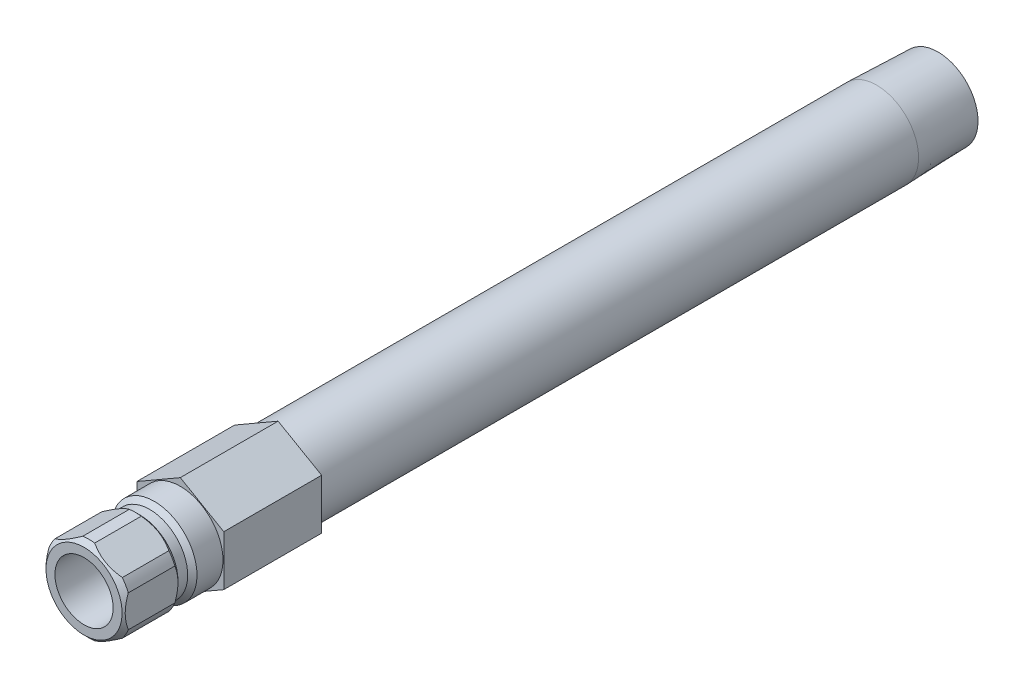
ISO-10303-21;
HEADER;
FILE_DESCRIPTION(('STEP AP214'),'2;1');
FILE_NAME('part.step','',(''),(''),'','','');
FILE_SCHEMA(('AUTOMOTIVE_DESIGN { 1 0 10303 214 1 1 1 1 }'));
ENDSEC;
DATA;
#1=APPLICATION_CONTEXT('core data for automotive mechanical design processes');
#2=APPLICATION_PROTOCOL_DEFINITION('international standard','automotive_design',2000,#1);
#3=PRODUCT_CONTEXT('',#1,'mechanical');
#4=PRODUCT('Part','Part','',(#3));
#5=PRODUCT_RELATED_PRODUCT_CATEGORY('part','',(#4));
#6=PRODUCT_DEFINITION_FORMATION('','',#4);
#7=PRODUCT_DEFINITION_CONTEXT('part definition',#1,'design');
#8=PRODUCT_DEFINITION('design','',#6,#7);
#9=PRODUCT_DEFINITION_SHAPE('','',#8);
#10=(LENGTH_UNIT() NAMED_UNIT(*) SI_UNIT(.MILLI.,.METRE.));
#11=(NAMED_UNIT(*) PLANE_ANGLE_UNIT() SI_UNIT($,.RADIAN.));
#12=(NAMED_UNIT(*) SI_UNIT($,.STERADIAN.) SOLID_ANGLE_UNIT());
#13=UNCERTAINTY_MEASURE_WITH_UNIT(LENGTH_MEASURE(1.E-05),#10,'distance_accuracy_value','');
#14=(GEOMETRIC_REPRESENTATION_CONTEXT(3) GLOBAL_UNCERTAINTY_ASSIGNED_CONTEXT((#13)) GLOBAL_UNIT_ASSIGNED_CONTEXT((#10,
#11,#12)) REPRESENTATION_CONTEXT('',''));
#15=CARTESIAN_POINT('',(0.,0.,0.));
#16=DIRECTION('',(0.,0.,1.));
#17=DIRECTION('',(1.,0.,0.));
#18=AXIS2_PLACEMENT_3D('',#15,#16,#17);
#19=CARTESIAN_POINT('',(0.,0.,12.8748331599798));
#20=DIRECTION('',(0.,0.,-1.));
#21=DIRECTION('',(0.,1.,0.));
#22=AXIS2_PLACEMENT_3D('',#19,#20,#21);
#23=CYLINDRICAL_SURFACE('',#22,6.985);
#24=DIRECTION('',(0.,0.,-1.));
#25=VECTOR('',#24,1.);
#26=CARTESIAN_POINT('',(5.50323442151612,-4.30170151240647,12.8748331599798));
#27=LINE('',#26,#25);
#28=CARTESIAN_POINT('',(5.50323442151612,-4.30170151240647,7.366));
#29=VERTEX_POINT('',#28);
#30=CARTESIAN_POINT('',(5.50323442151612,-4.30170151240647,14.986));
#31=VERTEX_POINT('',#30);
#32=EDGE_CURVE('E452',#29,#31,#27,.F.);
#33=ORIENTED_EDGE('',*,*,#32,.F.);
#34=CARTESIAN_POINT('',(0.,0.,7.366));
#35=DIRECTION('',(0.,0.,-1.));
#36=DIRECTION('',(0.,1.,0.));
#37=AXIS2_PLACEMENT_3D('',#34,#35,#36);
#38=CIRCLE('',#37,6.985);
#39=CARTESIAN_POINT('',(6.477,-2.6150900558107,7.366));
#40=VERTEX_POINT('',#39);
#41=EDGE_CURVE('E190',#40,#29,#38,.T.);
#42=ORIENTED_EDGE('',*,*,#41,.F.);
#43=DIRECTION('',(0.,0.,-1.));
#44=VECTOR('',#43,1.);
#45=CARTESIAN_POINT('',(6.477,-2.6150900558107,12.8748331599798));
#46=LINE('',#45,#44);
#47=CARTESIAN_POINT('',(6.477,-2.6150900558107,14.986));
#48=VERTEX_POINT('',#47);
#49=EDGE_CURVE('E367',#48,#40,#46,.T.);
#50=ORIENTED_EDGE('',*,*,#49,.F.);
#51=CARTESIAN_POINT('',(0.,0.,14.986));
#52=DIRECTION('',(0.,0.,-1.));
#53=DIRECTION('',(0.,1.,0.));
#54=AXIS2_PLACEMENT_3D('',#51,#52,#53);
#55=CIRCLE('',#54,6.985);
#56=EDGE_CURVE('E355',#48,#31,#55,.T.);
#57=ORIENTED_EDGE('',*,*,#56,.T.);
#58=EDGE_LOOP('',(#33,#42,#50,#57));
#59=FACE_BOUND('',#58,.T.);
#60=ADVANCED_FACE('F34',(#59),#23,.T.);
#61=DIRECTION('',(0.,0.,-1.));
#62=VECTOR('',#61,1.);
#63=CARTESIAN_POINT('',(6.477,2.6150900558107,12.8748331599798));
#64=LINE('',#63,#62);
#65=CARTESIAN_POINT('',(6.477,2.6150900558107,7.366));
#66=VERTEX_POINT('',#65);
#67=CARTESIAN_POINT('',(6.477,2.6150900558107,14.986));
#68=VERTEX_POINT('',#67);
#69=EDGE_CURVE('E279',#66,#68,#64,.F.);
#70=ORIENTED_EDGE('',*,*,#69,.F.);
#71=CARTESIAN_POINT('',(5.50323442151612,4.30170151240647,7.366));
#72=VERTEX_POINT('',#71);
#73=EDGE_CURVE('E193',#72,#66,#38,.T.);
#74=ORIENTED_EDGE('',*,*,#73,.F.);
#75=DIRECTION('',(0.,0.,-1.));
#76=VECTOR('',#75,1.);
#77=CARTESIAN_POINT('',(5.50323442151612,4.30170151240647,12.8748331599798));
#78=LINE('',#77,#76);
#79=CARTESIAN_POINT('',(5.50323442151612,4.30170151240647,14.986));
#80=VERTEX_POINT('',#79);
#81=EDGE_CURVE('E351',#80,#72,#78,.T.);
#82=ORIENTED_EDGE('',*,*,#81,.F.);
#83=EDGE_CURVE('E205',#80,#68,#55,.T.);
#84=ORIENTED_EDGE('',*,*,#83,.T.);
#85=EDGE_LOOP('',(#70,#74,#82,#84));
#86=FACE_BOUND('',#85,.T.);
#87=ADVANCED_FACE('F313',(#86),#23,.T.);
#88=DIRECTION('',(0.,0.,-1.));
#89=VECTOR('',#88,1.);
#90=CARTESIAN_POINT('',(0.973765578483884,6.91679156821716,12.8748331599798));
#91=LINE('',#90,#89);
#92=CARTESIAN_POINT('',(0.973765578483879,6.91679156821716,7.366));
#93=VERTEX_POINT('',#92);
#94=CARTESIAN_POINT('',(0.973765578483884,6.91679156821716,14.986));
#95=VERTEX_POINT('',#94);
#96=EDGE_CURVE('E370',#93,#95,#91,.F.);
#97=ORIENTED_EDGE('',*,*,#96,.F.);
#98=CARTESIAN_POINT('',(-0.97376557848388,6.91679156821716,7.366));
#99=VERTEX_POINT('',#98);
#100=EDGE_CURVE('E195',#99,#93,#38,.T.);
#101=ORIENTED_EDGE('',*,*,#100,.F.);
#102=DIRECTION('',(0.,0.,-1.));
#103=VECTOR('',#102,1.);
#104=CARTESIAN_POINT('',(-0.973765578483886,6.91679156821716,12.8748331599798));
#105=LINE('',#104,#103);
#106=CARTESIAN_POINT('',(-0.973765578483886,6.91679156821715,14.986));
#107=VERTEX_POINT('',#106);
#108=EDGE_CURVE('E54',#107,#99,#105,.T.);
#109=ORIENTED_EDGE('',*,*,#108,.F.);
#110=EDGE_CURVE('E201',#107,#95,#55,.T.);
#111=ORIENTED_EDGE('',*,*,#110,.T.);
#112=EDGE_LOOP('',(#97,#101,#109,#111));
#113=FACE_BOUND('',#112,.T.);
#114=ADVANCED_FACE('F318',(#113),#23,.T.);
#115=DIRECTION('',(0.,0.,-1.));
#116=VECTOR('',#115,1.);
#117=CARTESIAN_POINT('',(-5.50323442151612,4.30170151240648,12.8748331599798));
#118=LINE('',#117,#116);
#119=CARTESIAN_POINT('',(-5.50323442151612,4.30170151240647,7.366));
#120=VERTEX_POINT('',#119);
#121=CARTESIAN_POINT('',(-5.50323442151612,4.30170151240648,14.986));
#122=VERTEX_POINT('',#121);
#123=EDGE_CURVE('E349',#120,#122,#118,.F.);
#124=ORIENTED_EDGE('',*,*,#123,.F.);
#125=CARTESIAN_POINT('',(-6.477,2.61509005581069,7.366));
#126=VERTEX_POINT('',#125);
#127=EDGE_CURVE('E194',#126,#120,#38,.T.);
#128=ORIENTED_EDGE('',*,*,#127,.F.);
#129=DIRECTION('',(0.,0.,-1.));
#130=VECTOR('',#129,1.);
#131=CARTESIAN_POINT('',(-6.477,2.61509005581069,12.8748331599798));
#132=LINE('',#131,#130);
#133=CARTESIAN_POINT('',(-6.477,2.61509005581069,14.986));
#134=VERTEX_POINT('',#133);
#135=EDGE_CURVE('E62',#134,#126,#132,.T.);
#136=ORIENTED_EDGE('',*,*,#135,.F.);
#137=EDGE_CURVE('E204',#134,#122,#55,.T.);
#138=ORIENTED_EDGE('',*,*,#137,.T.);
#139=EDGE_LOOP('',(#124,#128,#136,#138));
#140=FACE_BOUND('',#139,.T.);
#141=ADVANCED_FACE('F329',(#140),#23,.T.);
#142=DIRECTION('',(0.,0.,-1.));
#143=VECTOR('',#142,1.);
#144=CARTESIAN_POINT('',(-6.477,-2.61509005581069,12.8748331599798));
#145=LINE('',#144,#143);
#146=CARTESIAN_POINT('',(-6.477,-2.61509005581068,7.366));
#147=VERTEX_POINT('',#146);
#148=CARTESIAN_POINT('',(-6.477,-2.61509005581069,14.986));
#149=VERTEX_POINT('',#148);
#150=EDGE_CURVE('E340',#147,#149,#145,.F.);
#151=ORIENTED_EDGE('',*,*,#150,.F.);
#152=CARTESIAN_POINT('',(-5.50323442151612,-4.30170151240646,7.366));
#153=VERTEX_POINT('',#152);
#154=EDGE_CURVE('E191',#153,#147,#38,.T.);
#155=ORIENTED_EDGE('',*,*,#154,.F.);
#156=DIRECTION('',(0.,0.,-1.));
#157=VECTOR('',#156,1.);
#158=CARTESIAN_POINT('',(-5.50323442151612,-4.30170151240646,12.8748331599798));
#159=LINE('',#158,#157);
#160=CARTESIAN_POINT('',(-5.50323442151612,-4.30170151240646,14.986));
#161=VERTEX_POINT('',#160);
#162=EDGE_CURVE('E168',#161,#153,#159,.T.);
#163=ORIENTED_EDGE('',*,*,#162,.F.);
#164=EDGE_CURVE('E342',#161,#149,#55,.T.);
#165=ORIENTED_EDGE('',*,*,#164,.T.);
#166=EDGE_LOOP('',(#151,#155,#163,#165));
#167=FACE_BOUND('',#166,.T.);
#168=ADVANCED_FACE('F322',(#167),#23,.T.);
#169=CARTESIAN_POINT('',(0.,0.,12.8748331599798));
#170=DIRECTION('',(0.,0.,-1.));
#171=DIRECTION('',(0.,1.,0.));
#172=AXIS2_PLACEMENT_3D('',#169,#170,#171);
#173=CYLINDRICAL_SURFACE('',#172,6.85799999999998);
#174=CARTESIAN_POINT('',(0.,0.,-113.919));
#175=DIRECTION('',(0.,0.,-1.));
#176=DIRECTION('',(0.,1.,0.));
#177=AXIS2_PLACEMENT_3D('',#174,#175,#176);
#178=CIRCLE('',#177,6.85799999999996);
#179=CARTESIAN_POINT('',(0.,6.858,-113.919));
#180=VERTEX_POINT('',#179);
#181=EDGE_CURVE('E520',#180,#180,#178,.T.);
#182=ORIENTED_EDGE('',*,*,#181,.F.);
#183=EDGE_LOOP('',(#182));
#184=FACE_BOUND('',#183,.T.);
#185=CARTESIAN_POINT('',(0.,0.,-16.002));
#186=DIRECTION('',(0.,0.,1.));
#187=DIRECTION('',(1.,0.,0.));
#188=AXIS2_PLACEMENT_3D('',#185,#186,#187);
#189=CIRCLE('',#188,6.85799999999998);
#190=CARTESIAN_POINT('',(6.85799999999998,0.,-16.002));
#191=VERTEX_POINT('',#190);
#192=EDGE_CURVE('E496',#191,#191,#189,.F.);
#193=ORIENTED_EDGE('',*,*,#192,.T.);
#194=EDGE_LOOP('',(#193));
#195=FACE_BOUND('',#194,.T.);
#196=ADVANCED_FACE('F328',(#184,#195),#173,.T.);
#197=CARTESIAN_POINT('',(0.,0.,12.8748331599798));
#198=DIRECTION('',(0.,0.,-1.));
#199=DIRECTION('',(0.,1.,0.));
#200=AXIS2_PLACEMENT_3D('',#197,#198,#199);
#201=CYLINDRICAL_SURFACE('',#200,4.7625);
#202=CARTESIAN_POINT('',(0.,0.,3.556));
#203=DIRECTION('',(0.,0.,-1.));
#204=DIRECTION('',(0.,1.,0.));
#205=AXIS2_PLACEMENT_3D('',#202,#203,#204);
#206=CIRCLE('',#205,4.76249999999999);
#207=CARTESIAN_POINT('',(0.,4.7625,3.556));
#208=VERTEX_POINT('',#207);
#209=EDGE_CURVE('E508',#208,#208,#206,.T.);
#210=ORIENTED_EDGE('',*,*,#209,.T.);
#211=EDGE_LOOP('',(#210));
#212=FACE_BOUND('',#211,.T.);
#213=CARTESIAN_POINT('',(0.,0.,15.748));
#214=DIRECTION('',(0.,0.,-1.));
#215=DIRECTION('',(0.,1.,0.));
#216=AXIS2_PLACEMENT_3D('',#213,#214,#215);
#217=CIRCLE('',#216,4.7625);
#218=CARTESIAN_POINT('',(0.,4.7625,15.748));
#219=VERTEX_POINT('',#218);
#220=EDGE_CURVE('E174',#219,#219,#217,.T.);
#221=ORIENTED_EDGE('',*,*,#220,.F.);
#222=EDGE_LOOP('',(#221));
#223=FACE_BOUND('',#222,.T.);
#224=ADVANCED_FACE('F36',(#212,#223),#201,.F.);
#225=CARTESIAN_POINT('',(0.,4.7625,15.748));
#226=DIRECTION('',(0.,0.,1.));
#227=DIRECTION('',(0.,-1.,0.));
#228=AXIS2_PLACEMENT_3D('',#225,#226,#227);
#229=PLANE('',#228);
#230=ORIENTED_EDGE('',*,*,#220,.T.);
#231=EDGE_LOOP('',(#230));
#232=FACE_BOUND('',#231,.T.);
#233=CARTESIAN_POINT('',(0.,0.,15.748));
#234=DIRECTION('',(0.,0.,-1.));
#235=DIRECTION('',(0.,1.,0.));
#236=AXIS2_PLACEMENT_3D('',#233,#234,#235);
#237=CIRCLE('',#236,6.223);
#238=CARTESIAN_POINT('',(0.,6.223,15.748));
#239=VERTEX_POINT('',#238);
#240=EDGE_CURVE('E206',#239,#239,#237,.T.);
#241=ORIENTED_EDGE('',*,*,#240,.F.);
#242=EDGE_LOOP('',(#241));
#243=FACE_BOUND('',#242,.T.);
#244=ADVANCED_FACE('F241',(#232,#243),#229,.T.);
#245=CARTESIAN_POINT('',(0.,0.,14.986));
#246=DIRECTION('',(0.,0.,-1.));
#247=DIRECTION('',(0.,1.,0.));
#248=AXIS2_PLACEMENT_3D('',#245,#246,#247);
#249=CONICAL_SURFACE('',#248,6.985,0.785398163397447);
#250=CARTESIAN_POINT('',(5.50369701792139,-4.30143443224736,14.9858));
#251=CARTESIAN_POINT('',(5.32269478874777,-4.40593611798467,15.0641166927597));
#252=CARTESIAN_POINT('',(5.13917907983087,-4.51188896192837,15.1353544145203));
#253=CARTESIAN_POINT('',(4.76736839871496,-4.72655395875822,15.2608524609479));
#254=CARTESIAN_POINT('',(4.57906245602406,-4.83527244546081,15.3150691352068));
#255=CARTESIAN_POINT('',(4.20553846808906,-5.05092662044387,15.401724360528));
#256=CARTESIAN_POINT('',(4.02044501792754,-5.15779037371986,15.4348622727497));
#257=CARTESIAN_POINT('',(3.64855359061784,-5.37250198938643,15.4802195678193));
#258=CARTESIAN_POINT('',(3.46175806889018,-5.48034843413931,15.4924653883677));
#259=CARTESIAN_POINT('',(3.08219421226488,-5.69948972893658,15.4953056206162));
#260=CARTESIAN_POINT('',(2.88942157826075,-5.81078706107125,15.4852117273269));
#261=CARTESIAN_POINT('',(2.50551871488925,-6.03243348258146,15.4426708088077));
#262=CARTESIAN_POINT('',(2.31439108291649,-6.14278107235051,15.4101933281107));
#263=CARTESIAN_POINT('',(1.92845877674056,-6.36559919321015,15.3234273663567));
#264=CARTESIAN_POINT('',(1.73378601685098,-6.47799356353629,15.268364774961));
#265=CARTESIAN_POINT('',(1.44558978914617,-6.6443837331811,15.1720079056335));
#266=CARTESIAN_POINT('',(1.35026676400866,-6.69941850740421,15.1376422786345));
#267=CARTESIAN_POINT('',(1.16086120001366,-6.80877186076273,15.0647445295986));
#268=CARTESIAN_POINT('',(1.06677820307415,-6.86309070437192,15.0262139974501));
#269=CARTESIAN_POINT('',(0.973302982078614,-6.91705864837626,14.9858));
#270=B_SPLINE_CURVE_WITH_KNOTS('',3,(#250,#251,#252,#253,#254,#255,#256,#257,#258,#259,#260,
#261,#262,#263,#264,#265,#266,#267,#268,#269),.UNSPECIFIED.,.F.,.F.,(4,2,2,2,2,2,2,2,2,4),(0.,
0.669810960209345,1.34132587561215,1.9892054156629,2.63626449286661,3.30353665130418,
3.97171850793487,4.66502165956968,5.01088265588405,5.35661208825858),.UNSPECIFIED.);
#271=CARTESIAN_POINT('',(0.973765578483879,-6.91679156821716,14.986));
#272=VERTEX_POINT('',#271);
#273=EDGE_CURVE('E451',#31,#272,#270,.T.);
#274=ORIENTED_EDGE('',*,*,#273,.F.);
#275=ORIENTED_EDGE('',*,*,#56,.F.);
#276=CARTESIAN_POINT('',(6.477,-7.50531717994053,12.0573066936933));
#277=CARTESIAN_POINT('',(6.477,-7.32278230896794,12.1954662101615));
#278=CARTESIAN_POINT('',(6.477,-7.13923073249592,12.3323042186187));
#279=CARTESIAN_POINT('',(6.477,-6.76969107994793,12.6027438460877));
#280=CARTESIAN_POINT('',(6.477,-6.58370240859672,12.7363446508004));
#281=CARTESIAN_POINT('',(6.477,-6.20752484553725,13.0006667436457));
#282=CARTESIAN_POINT('',(6.477,-6.01731457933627,13.1313577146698));
#283=CARTESIAN_POINT('',(6.477,-5.63367369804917,13.3879087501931));
#284=CARTESIAN_POINT('',(6.477,-5.44024331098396,13.5137691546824));
#285=CARTESIAN_POINT('',(6.477,-5.03831720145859,13.7667102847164));
#286=CARTESIAN_POINT('',(6.477,-4.8295984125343,13.893438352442));
#287=CARTESIAN_POINT('',(6.477,-4.4072839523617,14.1386241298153));
#288=CARTESIAN_POINT('',(6.477,-4.19368750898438,14.2570805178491));
#289=CARTESIAN_POINT('',(6.477,-3.7616267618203,14.4831715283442));
#290=CARTESIAN_POINT('',(6.477,-3.54317924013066,14.5908379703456));
#291=CARTESIAN_POINT('',(6.477,-3.100295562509,14.7929384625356));
#292=CARTESIAN_POINT('',(6.477,-2.87586219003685,14.8873785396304));
#293=CARTESIAN_POINT('',(6.477,-2.43955826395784,15.0524966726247));
#294=CARTESIAN_POINT('',(6.477,-2.22819339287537,15.1244971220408));
#295=CARTESIAN_POINT('',(6.477,-1.80033354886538,15.2515475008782));
#296=CARTESIAN_POINT('',(6.477,-1.58383822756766,15.3065962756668));
#297=CARTESIAN_POINT('',(6.477,-1.15063390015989,15.3959385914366));
#298=CARTESIAN_POINT('',(6.477,-0.934000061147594,15.4305906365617));
#299=CARTESIAN_POINT('',(6.477,-0.498364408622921,15.4784594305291));
#300=CARTESIAN_POINT('',(6.477,-0.279363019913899,15.4916799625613));
#301=CARTESIAN_POINT('',(6.477,0.150697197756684,15.4956835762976));
#302=CARTESIAN_POINT('',(6.477,0.361748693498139,15.4872823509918));
#303=CARTESIAN_POINT('',(6.477,0.782066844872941,15.4503172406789));
#304=CARTESIAN_POINT('',(6.477,0.991333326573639,15.421751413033));
#305=CARTESIAN_POINT('',(6.477,1.41010575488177,15.3455375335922));
#306=CARTESIAN_POINT('',(6.477,1.6195513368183,15.2975631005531));
#307=CARTESIAN_POINT('',(6.477,2.03387291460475,15.1851046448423));
#308=CARTESIAN_POINT('',(6.477,2.2387492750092,15.1206219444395));
#309=CARTESIAN_POINT('',(6.477,2.66141718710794,14.9715598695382));
#310=CARTESIAN_POINT('',(6.477,2.87875617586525,14.8857103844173));
#311=CARTESIAN_POINT('',(6.477,3.30779766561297,14.7008180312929));
#312=CARTESIAN_POINT('',(6.477,3.51949749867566,14.6017690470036));
#313=CARTESIAN_POINT('',(6.477,3.9382898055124,14.3928329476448));
#314=CARTESIAN_POINT('',(6.477,4.14536521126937,14.282911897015));
#315=CARTESIAN_POINT('',(6.477,4.55475391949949,14.0546596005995));
#316=CARTESIAN_POINT('',(6.477,4.75706796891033,13.93632968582));
#317=CARTESIAN_POINT('',(6.477,5.14761370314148,13.6989609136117));
#318=CARTESIAN_POINT('',(6.477,5.33604552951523,13.580249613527));
#319=CARTESIAN_POINT('',(6.477,5.70967381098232,13.3378251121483));
#320=CARTESIAN_POINT('',(6.477,5.89487001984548,13.2141115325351));
#321=CARTESIAN_POINT('',(6.477,6.26095063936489,12.9635958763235));
#322=CARTESIAN_POINT('',(6.477,6.44185783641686,12.8368269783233));
#323=CARTESIAN_POINT('',(6.477,6.80119835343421,12.5799293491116));
#324=CARTESIAN_POINT('',(6.477,6.97963234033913,12.4498015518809));
#325=CARTESIAN_POINT('',(6.477,7.15703038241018,12.3183002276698));
#326=B_SPLINE_CURVE_WITH_KNOTS('',3,(#276,#277,#278,#279,#280,#281,#282,#283,#284,#285,#286,
#287,#288,#289,#290,#291,#292,#293,#294,#295,#296,#297,#298,#299,#300,#301,#302,#303,#304,#305,
#306,#307,#308,#309,#310,#311,#312,#313,#314,#315,#316,#317,#318,#319,#320,#321,#322,#323,#324,
#325),.UNSPECIFIED.,.F.,.F.,(4,2,2,2,2,2,2,2,2,2,2,2,2,2,2,2,2,2,2,2,2,2,2,2,4),(0.,
0.686790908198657,1.37375281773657,2.06603541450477,2.75826919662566,3.49065471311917,
4.22315698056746,4.95343127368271,5.68337170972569,6.35265989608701,7.02199365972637,
7.67918147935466,8.33625327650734,8.96890298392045,9.6016136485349,10.2454384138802,
10.8892116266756,11.5897073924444,12.2905288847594,12.9936114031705,13.6965828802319,
14.3646145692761,15.0326968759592,15.6953618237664,16.3578444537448),.UNSPECIFIED.);
#327=EDGE_CURVE('E271',#68,#48,#326,.F.);
#328=ORIENTED_EDGE('',*,*,#327,.F.);
#329=ORIENTED_EDGE('',*,*,#83,.F.);
#330=CARTESIAN_POINT('',(0.973302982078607,6.91705864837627,14.9858));
#331=CARTESIAN_POINT('',(1.15430521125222,6.81255696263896,15.0641166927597));
#332=CARTESIAN_POINT('',(1.33782092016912,6.70660411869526,15.1353544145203));
#333=CARTESIAN_POINT('',(1.70963160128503,6.49193912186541,15.2608524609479));
#334=CARTESIAN_POINT('',(1.89793754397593,6.38322063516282,15.3150691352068));
#335=CARTESIAN_POINT('',(2.27146153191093,6.16756646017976,15.401724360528));
#336=CARTESIAN_POINT('',(2.45655498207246,6.06070270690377,15.4348622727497));
#337=CARTESIAN_POINT('',(2.82844640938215,5.8459910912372,15.4802195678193));
#338=CARTESIAN_POINT('',(3.01524193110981,5.73814464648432,15.4924653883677));
#339=CARTESIAN_POINT('',(3.39480578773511,5.51900335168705,15.4953056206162));
#340=CARTESIAN_POINT('',(3.58757842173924,5.40770601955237,15.4852117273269));
#341=CARTESIAN_POINT('',(3.97148128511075,5.18605959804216,15.4426708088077));
#342=CARTESIAN_POINT('',(4.16260891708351,5.07571200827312,15.4101933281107));
#343=CARTESIAN_POINT('',(4.54854122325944,4.85289388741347,15.3234273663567));
#344=CARTESIAN_POINT('',(4.74321398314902,4.74049951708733,15.268364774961));
#345=CARTESIAN_POINT('',(5.03141021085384,4.57410934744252,15.1720079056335));
#346=CARTESIAN_POINT('',(5.12673323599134,4.51907457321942,15.1376422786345));
#347=CARTESIAN_POINT('',(5.31613879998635,4.40972121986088,15.0647445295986));
#348=CARTESIAN_POINT('',(5.41022179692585,4.3554023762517,15.0262139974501));
#349=CARTESIAN_POINT('',(5.50369701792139,4.30143443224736,14.9858));
#350=B_SPLINE_CURVE_WITH_KNOTS('',3,(#330,#331,#332,#333,#334,#335,#336,#337,#338,#339,#340,
#341,#342,#343,#344,#345,#346,#347,#348,#349),.UNSPECIFIED.,.F.,.F.,(4,2,2,2,2,2,2,2,2,4),(0.,
0.669810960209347,1.34132587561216,1.9892054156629,2.63626449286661,3.30353665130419,
3.97171850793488,4.66502165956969,5.01088265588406,5.35661208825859),.UNSPECIFIED.);
#351=EDGE_CURVE('E263',#95,#80,#350,.T.);
#352=ORIENTED_EDGE('',*,*,#351,.F.);
#353=ORIENTED_EDGE('',*,*,#110,.F.);
#354=CARTESIAN_POINT('',(-5.50369701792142,4.30143443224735,14.9858));
#355=CARTESIAN_POINT('',(-5.3226947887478,4.40593611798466,15.0641166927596));
#356=CARTESIAN_POINT('',(-5.1391790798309,4.51188896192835,15.1353544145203));
#357=CARTESIAN_POINT('',(-4.76736839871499,4.72655395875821,15.2608524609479));
#358=CARTESIAN_POINT('',(-4.57906245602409,4.8352724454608,15.3150691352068));
#359=CARTESIAN_POINT('',(-4.20553846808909,5.05092662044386,15.401724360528));
#360=CARTESIAN_POINT('',(-4.02044501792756,5.15779037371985,15.4348622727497));
#361=CARTESIAN_POINT('',(-3.64855359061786,5.37250198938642,15.4802195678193));
#362=CARTESIAN_POINT('',(-3.4617580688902,5.4803484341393,15.4924653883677));
#363=CARTESIAN_POINT('',(-3.0821942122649,5.69948972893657,15.4953056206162));
#364=CARTESIAN_POINT('',(-2.88942157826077,5.81078706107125,15.4852117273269));
#365=CARTESIAN_POINT('',(-2.50551871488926,6.03243348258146,15.4426708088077));
#366=CARTESIAN_POINT('',(-2.3143910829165,6.14278107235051,15.4101933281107));
#367=CARTESIAN_POINT('',(-1.92845877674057,6.36559919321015,15.3234273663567));
#368=CARTESIAN_POINT('',(-1.73378601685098,6.47799356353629,15.268364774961));
#369=CARTESIAN_POINT('',(-1.44558978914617,6.6443837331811,15.1720079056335));
#370=CARTESIAN_POINT('',(-1.35026676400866,6.69941850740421,15.1376422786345));
#371=CARTESIAN_POINT('',(-1.16086120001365,6.80877186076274,15.0647445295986));
#372=CARTESIAN_POINT('',(-1.06677820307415,6.86309070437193,15.0262139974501));
#373=CARTESIAN_POINT('',(-0.97330298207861,6.91705864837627,14.9858));
#374=B_SPLINE_CURVE_WITH_KNOTS('',3,(#354,#355,#356,#357,#358,#359,#360,#361,#362,#363,#364,
#365,#366,#367,#368,#369,#370,#371,#372,#373),.UNSPECIFIED.,.F.,.F.,(4,2,2,2,2,2,2,2,2,4),(0.,
0.66981096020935,1.34132587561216,1.98920541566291,2.63626449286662,3.3035366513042,
3.9717185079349,4.66502165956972,5.01088265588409,5.35661208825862),.UNSPECIFIED.);
#375=EDGE_CURVE('E256',#122,#107,#374,.T.);
#376=ORIENTED_EDGE('',*,*,#375,.F.);
#377=ORIENTED_EDGE('',*,*,#137,.F.);
#378=CARTESIAN_POINT('',(-6.477,-7.50531717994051,12.0573066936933));
#379=CARTESIAN_POINT('',(-6.477,-7.32278230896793,12.1954662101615));
#380=CARTESIAN_POINT('',(-6.477,-7.13923073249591,12.3323042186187));
#381=CARTESIAN_POINT('',(-6.477,-6.76969107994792,12.6027438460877));
#382=CARTESIAN_POINT('',(-6.477,-6.58370240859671,12.7363446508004));
#383=CARTESIAN_POINT('',(-6.477,-6.20752484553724,13.0006667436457));
#384=CARTESIAN_POINT('',(-6.477,-6.01731457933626,13.1313577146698));
#385=CARTESIAN_POINT('',(-6.477,-5.63367369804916,13.3879087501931));
#386=CARTESIAN_POINT('',(-6.477,-5.44024331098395,13.5137691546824));
#387=CARTESIAN_POINT('',(-6.477,-5.03831720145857,13.7667102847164));
#388=CARTESIAN_POINT('',(-6.477,-4.82959841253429,13.8934383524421));
#389=CARTESIAN_POINT('',(-6.477,-4.40728395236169,14.1386241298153));
#390=CARTESIAN_POINT('',(-6.477,-4.19368750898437,14.2570805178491));
#391=CARTESIAN_POINT('',(-6.477,-3.76162676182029,14.4831715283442));
#392=CARTESIAN_POINT('',(-6.477,-3.54317924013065,14.5908379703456));
#393=CARTESIAN_POINT('',(-6.477,-3.10029556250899,14.7929384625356));
#394=CARTESIAN_POINT('',(-6.477,-2.87586219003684,14.8873785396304));
#395=CARTESIAN_POINT('',(-6.477,-2.43955826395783,15.0524966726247));
#396=CARTESIAN_POINT('',(-6.477,-2.22819339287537,15.1244971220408));
#397=CARTESIAN_POINT('',(-6.477,-1.80033354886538,15.2515475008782));
#398=CARTESIAN_POINT('',(-6.477,-1.58383822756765,15.3065962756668));
#399=CARTESIAN_POINT('',(-6.477,-1.15063390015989,15.3959385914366));
#400=CARTESIAN_POINT('',(-6.477,-0.934000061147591,15.4305906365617));
#401=CARTESIAN_POINT('',(-6.477,-0.49836440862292,15.4784594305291));
#402=CARTESIAN_POINT('',(-6.477,-0.279363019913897,15.4916799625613));
#403=CARTESIAN_POINT('',(-6.477,0.150697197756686,15.4956835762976));
#404=CARTESIAN_POINT('',(-6.477,0.361748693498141,15.4872823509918));
#405=CARTESIAN_POINT('',(-6.477,0.782066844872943,15.4503172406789));
#406=CARTESIAN_POINT('',(-6.477,0.991333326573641,15.421751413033));
#407=CARTESIAN_POINT('',(-6.477,1.41010575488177,15.3455375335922));
#408=CARTESIAN_POINT('',(-6.477,1.6195513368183,15.2975631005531));
#409=CARTESIAN_POINT('',(-6.477,2.03387291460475,15.1851046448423));
#410=CARTESIAN_POINT('',(-6.477,2.2387492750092,15.1206219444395));
#411=CARTESIAN_POINT('',(-6.477,2.66141718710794,14.9715598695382));
#412=CARTESIAN_POINT('',(-6.477,2.87875617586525,14.8857103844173));
#413=CARTESIAN_POINT('',(-6.477,3.30779766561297,14.7008180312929));
#414=CARTESIAN_POINT('',(-6.477,3.51949749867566,14.6017690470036));
#415=CARTESIAN_POINT('',(-6.477,3.93828980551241,14.3928329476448));
#416=CARTESIAN_POINT('',(-6.477,4.14536521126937,14.282911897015));
#417=CARTESIAN_POINT('',(-6.477,4.55475391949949,14.0546596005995));
#418=CARTESIAN_POINT('',(-6.477,4.75706796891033,13.93632968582));
#419=CARTESIAN_POINT('',(-6.477,5.14761370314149,13.6989609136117));
#420=CARTESIAN_POINT('',(-6.477,5.33604552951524,13.580249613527));
#421=CARTESIAN_POINT('',(-6.477,5.70967381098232,13.3378251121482));
#422=CARTESIAN_POINT('',(-6.477,5.89487001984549,13.2141115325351));
#423=CARTESIAN_POINT('',(-6.477,6.2609506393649,12.9635958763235));
#424=CARTESIAN_POINT('',(-6.477,6.44185783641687,12.8368269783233));
#425=CARTESIAN_POINT('',(-6.477,6.80119835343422,12.5799293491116));
#426=CARTESIAN_POINT('',(-6.477,6.97963234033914,12.4498015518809));
#427=CARTESIAN_POINT('',(-6.477,7.15703038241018,12.3183002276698));
#428=B_SPLINE_CURVE_WITH_KNOTS('',3,(#378,#379,#380,#381,#382,#383,#384,#385,#386,#387,#388,
#389,#390,#391,#392,#393,#394,#395,#396,#397,#398,#399,#400,#401,#402,#403,#404,#405,#406,#407,
#408,#409,#410,#411,#412,#413,#414,#415,#416,#417,#418,#419,#420,#421,#422,#423,#424,#425,#426,
#427),.UNSPECIFIED.,.F.,.F.,(4,2,2,2,2,2,2,2,2,2,2,2,2,2,2,2,2,2,2,2,2,2,2,2,4),(0.,
0.686790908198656,1.37375281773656,2.06603541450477,2.75826919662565,3.49065471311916,
4.22315698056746,4.9534312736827,5.68337170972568,6.352659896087,7.02199365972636,
7.67918147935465,8.33625327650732,8.96890298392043,9.60161364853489,10.2454384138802,
10.8892116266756,11.5897073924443,12.2905288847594,12.9936114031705,13.6965828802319,
14.3646145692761,15.0326968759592,15.6953618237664,16.3578444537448),.UNSPECIFIED.);
#429=EDGE_CURVE('E249',#149,#134,#428,.T.);
#430=ORIENTED_EDGE('',*,*,#429,.F.);
#431=ORIENTED_EDGE('',*,*,#164,.F.);
#432=CARTESIAN_POINT('',(-0.973302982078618,-6.91705864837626,14.9858));
#433=CARTESIAN_POINT('',(-1.15430521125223,-6.81255696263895,15.0641166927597));
#434=CARTESIAN_POINT('',(-1.33782092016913,-6.70660411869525,15.1353544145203));
#435=CARTESIAN_POINT('',(-1.70963160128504,-6.49193912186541,15.2608524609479));
#436=CARTESIAN_POINT('',(-1.89793754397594,-6.38322063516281,15.3150691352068));
#437=CARTESIAN_POINT('',(-2.27146153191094,-6.16756646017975,15.401724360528));
#438=CARTESIAN_POINT('',(-2.45655498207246,-6.06070270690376,15.4348622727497));
#439=CARTESIAN_POINT('',(-2.82844640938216,-5.84599109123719,15.4802195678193));
#440=CARTESIAN_POINT('',(-3.01524193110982,-5.73814464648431,15.4924653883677));
#441=CARTESIAN_POINT('',(-3.39480578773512,-5.51900335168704,15.4953056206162));
#442=CARTESIAN_POINT('',(-3.58757842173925,-5.40770601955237,15.4852117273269));
#443=CARTESIAN_POINT('',(-3.97148128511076,-5.18605959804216,15.4426708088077));
#444=CARTESIAN_POINT('',(-4.16260891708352,-5.07571200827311,15.4101933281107));
#445=CARTESIAN_POINT('',(-4.54854122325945,-4.85289388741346,15.3234273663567));
#446=CARTESIAN_POINT('',(-4.74321398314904,-4.74049951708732,15.268364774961));
#447=CARTESIAN_POINT('',(-5.03141021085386,-4.57410934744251,15.1720079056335));
#448=CARTESIAN_POINT('',(-5.12673323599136,-4.5190745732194,15.1376422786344));
#449=CARTESIAN_POINT('',(-5.31613879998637,-4.40972121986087,15.0647445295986));
#450=CARTESIAN_POINT('',(-5.41022179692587,-4.35540237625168,15.0262139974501));
#451=CARTESIAN_POINT('',(-5.50369701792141,-4.30143443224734,14.9858));
#452=B_SPLINE_CURVE_WITH_KNOTS('',3,(#432,#433,#434,#435,#436,#437,#438,#439,#440,#441,#442,
#443,#444,#445,#446,#447,#448,#449,#450,#451),.UNSPECIFIED.,.F.,.F.,(4,2,2,2,2,2,2,2,2,4),(0.,
0.669810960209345,1.34132587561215,1.9892054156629,2.6362644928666,3.30353665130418,
3.97171850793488,4.6650216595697,5.01088265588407,5.35661208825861),.UNSPECIFIED.);
#453=CARTESIAN_POINT('',(-0.973765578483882,-6.91679156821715,14.986));
#454=VERTEX_POINT('',#453);
#455=EDGE_CURVE('E184',#454,#161,#452,.T.);
#456=ORIENTED_EDGE('',*,*,#455,.F.);
#457=EDGE_CURVE('E183',#272,#454,#55,.T.);
#458=ORIENTED_EDGE('',*,*,#457,.F.);
#459=EDGE_LOOP('',(#274,#275,#328,#329,#352,#353,#376,#377,#430,#431,#456,#458));
#460=FACE_BOUND('',#459,.T.);
#461=ORIENTED_EDGE('',*,*,#240,.T.);
#462=EDGE_LOOP('',(#461));
#463=FACE_BOUND('',#462,.T.);
#464=ADVANCED_FACE('F238',(#460,#463),#249,.T.);
#465=DIRECTION('',(0.,0.,-1.));
#466=VECTOR('',#465,1.);
#467=CARTESIAN_POINT('',(0.973765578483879,-6.91679156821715,12.8748331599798));
#468=LINE('',#467,#466);
#469=CARTESIAN_POINT('',(0.973765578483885,-6.91679156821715,7.366));
#470=VERTEX_POINT('',#469);
#471=EDGE_CURVE('E278',#272,#470,#468,.T.);
#472=ORIENTED_EDGE('',*,*,#471,.F.);
#473=ORIENTED_EDGE('',*,*,#457,.T.);
#474=DIRECTION('',(0.,0.,-1.));
#475=VECTOR('',#474,1.);
#476=CARTESIAN_POINT('',(-0.973765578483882,-6.91679156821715,12.8748331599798));
#477=LINE('',#476,#475);
#478=CARTESIAN_POINT('',(-0.973765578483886,-6.91679156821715,7.366));
#479=VERTEX_POINT('',#478);
#480=EDGE_CURVE('E165',#479,#454,#477,.F.);
#481=ORIENTED_EDGE('',*,*,#480,.F.);
#482=EDGE_CURVE('E181',#470,#479,#38,.T.);
#483=ORIENTED_EDGE('',*,*,#482,.F.);
#484=EDGE_LOOP('',(#472,#473,#481,#483));
#485=FACE_BOUND('',#484,.T.);
#486=ADVANCED_FACE('F180',(#485),#23,.T.);
#487=CARTESIAN_POINT('',(0.,0.,6.604));
#488=DIRECTION('',(0.,0.,1.));
#489=DIRECTION('',(0.,-1.,0.));
#490=AXIS2_PLACEMENT_3D('',#487,#488,#489);
#491=CONICAL_SURFACE('',#490,6.223,0.785398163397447);
#492=CARTESIAN_POINT('',(0.973302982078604,-6.91705864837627,7.3662));
#493=CARTESIAN_POINT('',(1.15430521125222,-6.81255696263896,7.28788330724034));
#494=CARTESIAN_POINT('',(1.33782092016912,-6.70660411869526,7.21664558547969));
#495=CARTESIAN_POINT('',(1.70963160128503,-6.49193912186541,7.09114753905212));
#496=CARTESIAN_POINT('',(1.89793754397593,-6.38322063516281,7.03693086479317));
#497=CARTESIAN_POINT('',(2.27146153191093,-6.16756646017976,6.95027563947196));
#498=CARTESIAN_POINT('',(2.45655498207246,-6.06070270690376,6.91713772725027));
#499=CARTESIAN_POINT('',(2.82844640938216,-5.8459910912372,6.87178043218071));
#500=CARTESIAN_POINT('',(3.01524193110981,-5.73814464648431,6.85953461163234));
#501=CARTESIAN_POINT('',(3.39480578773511,-5.51900335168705,6.85669437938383));
#502=CARTESIAN_POINT('',(3.58757842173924,-5.40770601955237,6.86678827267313));
#503=CARTESIAN_POINT('',(3.97148128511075,-5.18605959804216,6.9093291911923));
#504=CARTESIAN_POINT('',(4.16260891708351,-5.07571200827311,6.9418066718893));
#505=CARTESIAN_POINT('',(4.54854122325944,-4.85289388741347,7.02857263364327));
#506=CARTESIAN_POINT('',(4.74321398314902,-4.74049951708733,7.08363522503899));
#507=CARTESIAN_POINT('',(5.03141021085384,-4.57410934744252,7.17999209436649));
#508=CARTESIAN_POINT('',(5.12673323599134,-4.51907457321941,7.21435772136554));
#509=CARTESIAN_POINT('',(5.31613879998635,-4.40972121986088,7.28725547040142));
#510=CARTESIAN_POINT('',(5.41022179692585,-4.35540237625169,7.32578600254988));
#511=CARTESIAN_POINT('',(5.50369701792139,-4.30143443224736,7.3662));
#512=B_SPLINE_CURVE_WITH_KNOTS('',3,(#492,#493,#494,#495,#496,#497,#498,#499,#500,#501,#502,
#503,#504,#505,#506,#507,#508,#509,#510,#511),.UNSPECIFIED.,.F.,.F.,(4,2,2,2,2,2,2,2,2,4),(0.,
0.669810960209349,1.34132587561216,1.9892054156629,2.63626449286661,3.30353665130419,
3.97171850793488,4.6650216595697,5.01088265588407,5.3566120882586),.UNSPECIFIED.);
#513=EDGE_CURVE('E12',#470,#29,#512,.T.);
#514=ORIENTED_EDGE('',*,*,#513,.F.);
#515=ORIENTED_EDGE('',*,*,#482,.T.);
#516=CARTESIAN_POINT('',(-5.50369701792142,-4.30143443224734,7.36620000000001));
#517=CARTESIAN_POINT('',(-5.32269478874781,-4.40593611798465,7.28788330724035));
#518=CARTESIAN_POINT('',(-5.13917907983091,-4.51188896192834,7.2166455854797));
#519=CARTESIAN_POINT('',(-4.767368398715,-4.7265539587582,7.09114753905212));
#520=CARTESIAN_POINT('',(-4.57906245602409,-4.83527244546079,7.03693086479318));
#521=CARTESIAN_POINT('',(-4.20553846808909,-5.05092662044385,6.95027563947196));
#522=CARTESIAN_POINT('',(-4.02044501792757,-5.15779037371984,6.91713772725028));
#523=CARTESIAN_POINT('',(-3.64855359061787,-5.37250198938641,6.87178043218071));
#524=CARTESIAN_POINT('',(-3.46175806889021,-5.48034843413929,6.85953461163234));
#525=CARTESIAN_POINT('',(-3.08219421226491,-5.69948972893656,6.85669437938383));
#526=CARTESIAN_POINT('',(-2.88942157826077,-5.81078706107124,6.86678827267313));
#527=CARTESIAN_POINT('',(-2.50551871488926,-6.03243348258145,6.9093291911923));
#528=CARTESIAN_POINT('',(-2.3143910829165,-6.1427810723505,6.9418066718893));
#529=CARTESIAN_POINT('',(-1.92845877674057,-6.36559919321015,7.02857263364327));
#530=CARTESIAN_POINT('',(-1.73378601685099,-6.47799356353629,7.08363522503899));
#531=CARTESIAN_POINT('',(-1.44558978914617,-6.6443837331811,7.17999209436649));
#532=CARTESIAN_POINT('',(-1.35026676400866,-6.69941850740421,7.21435772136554));
#533=CARTESIAN_POINT('',(-1.16086120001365,-6.80877186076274,7.28725547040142));
#534=CARTESIAN_POINT('',(-1.06677820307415,-6.86309070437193,7.32578600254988));
#535=CARTESIAN_POINT('',(-0.97330298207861,-6.91705864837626,7.3662));
#536=B_SPLINE_CURVE_WITH_KNOTS('',3,(#516,#517,#518,#519,#520,#521,#522,#523,#524,#525,#526,
#527,#528,#529,#530,#531,#532,#533,#534,#535),.UNSPECIFIED.,.F.,.F.,(4,2,2,2,2,2,2,2,2,4),(0.,
0.669810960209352,1.34132587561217,1.98920541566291,2.63626449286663,3.30353665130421,
3.9717185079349,4.66502165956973,5.0108826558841,5.35661208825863),.UNSPECIFIED.);
#537=EDGE_CURVE('E162',#153,#479,#536,.T.);
#538=ORIENTED_EDGE('',*,*,#537,.F.);
#539=ORIENTED_EDGE('',*,*,#154,.T.);
#540=CARTESIAN_POINT('',(-6.477,-7.50531717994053,10.2946933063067));
#541=CARTESIAN_POINT('',(-6.477,-7.32278230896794,10.1565337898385));
#542=CARTESIAN_POINT('',(-6.477,-7.13923073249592,10.0196957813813));
#543=CARTESIAN_POINT('',(-6.477,-6.76969107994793,9.74925615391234));
#544=CARTESIAN_POINT('',(-6.477,-6.58370240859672,9.61565534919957));
#545=CARTESIAN_POINT('',(-6.477,-6.20752484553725,9.35133325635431));
#546=CARTESIAN_POINT('',(-6.477,-6.01731457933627,9.22064228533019));
#547=CARTESIAN_POINT('',(-6.477,-5.63367369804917,8.96409124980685));
#548=CARTESIAN_POINT('',(-6.477,-5.44024331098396,8.83823084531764));
#549=CARTESIAN_POINT('',(-6.477,-5.03831720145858,8.58528971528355));
#550=CARTESIAN_POINT('',(-6.477,-4.8295984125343,8.45856164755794));
#551=CARTESIAN_POINT('',(-6.477,-4.4072839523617,8.21337587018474));
#552=CARTESIAN_POINT('',(-6.477,-4.19368750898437,8.09491948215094));
#553=CARTESIAN_POINT('',(-6.477,-3.7616267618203,7.8688284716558));
#554=CARTESIAN_POINT('',(-6.477,-3.54317924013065,7.76116202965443));
#555=CARTESIAN_POINT('',(-6.477,-3.100295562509,7.55906153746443));
#556=CARTESIAN_POINT('',(-6.477,-2.87586219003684,7.46462146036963));
#557=CARTESIAN_POINT('',(-6.477,-2.43955826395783,7.2995033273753));
#558=CARTESIAN_POINT('',(-6.477,-2.22819339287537,7.2275028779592));
#559=CARTESIAN_POINT('',(-6.477,-1.80033354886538,7.1004524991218));
#560=CARTESIAN_POINT('',(-6.477,-1.58383822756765,7.0454037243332));
#561=CARTESIAN_POINT('',(-6.477,-1.15063390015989,6.95606140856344));
#562=CARTESIAN_POINT('',(-6.477,-0.934000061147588,6.9214093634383));
#563=CARTESIAN_POINT('',(-6.477,-0.498364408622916,6.87354056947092));
#564=CARTESIAN_POINT('',(-6.477,-0.279363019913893,6.86032003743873));
#565=CARTESIAN_POINT('',(-6.477,0.15069719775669,6.85631642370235));
#566=CARTESIAN_POINT('',(-6.477,0.361748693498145,6.86471764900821));
#567=CARTESIAN_POINT('',(-6.477,0.782066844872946,6.90168275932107));
#568=CARTESIAN_POINT('',(-6.477,0.991333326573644,6.93024858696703));
#569=CARTESIAN_POINT('',(-6.477,1.41010575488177,7.00646246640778));
#570=CARTESIAN_POINT('',(-6.477,1.61955133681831,7.05443689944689));
#571=CARTESIAN_POINT('',(-6.477,2.03387291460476,7.16689535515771));
#572=CARTESIAN_POINT('',(-6.477,2.23874927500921,7.2313780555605));
#573=CARTESIAN_POINT('',(-6.477,2.66141718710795,7.38044013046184));
#574=CARTESIAN_POINT('',(-6.477,2.87875617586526,7.46628961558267));
#575=CARTESIAN_POINT('',(-6.477,3.30779766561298,7.65118196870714));
#576=CARTESIAN_POINT('',(-6.477,3.51949749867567,7.75023095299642));
#577=CARTESIAN_POINT('',(-6.477,3.93828980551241,7.95916705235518));
#578=CARTESIAN_POINT('',(-6.477,4.14536521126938,8.06908810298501));
#579=CARTESIAN_POINT('',(-6.477,4.5547539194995,8.2973403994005));
#580=CARTESIAN_POINT('',(-6.477,4.75706796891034,8.41567031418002));
#581=CARTESIAN_POINT('',(-6.477,5.1476137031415,8.65303908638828));
#582=CARTESIAN_POINT('',(-6.477,5.33604552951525,8.77175038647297));
#583=CARTESIAN_POINT('',(-6.477,5.70967381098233,9.01417488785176));
#584=CARTESIAN_POINT('',(-6.477,5.8948700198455,9.13788846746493));
#585=CARTESIAN_POINT('',(-6.477,6.26095063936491,9.38840412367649));
#586=CARTESIAN_POINT('',(-6.477,6.44185783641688,9.51517302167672));
#587=CARTESIAN_POINT('',(-6.477,6.80119835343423,9.7720706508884));
#588=CARTESIAN_POINT('',(-6.477,6.97963234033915,9.90219844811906));
#589=CARTESIAN_POINT('',(-6.477,7.1570303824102,10.0336997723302));
#590=B_SPLINE_CURVE_WITH_KNOTS('',3,(#540,#541,#542,#543,#544,#545,#546,#547,#548,#549,#550,
#551,#552,#553,#554,#555,#556,#557,#558,#559,#560,#561,#562,#563,#564,#565,#566,#567,#568,#569,
#570,#571,#572,#573,#574,#575,#576,#577,#578,#579,#580,#581,#582,#583,#584,#585,#586,#587,#588,
#589),.UNSPECIFIED.,.F.,.F.,(4,2,2,2,2,2,2,2,2,2,2,2,2,2,2,2,2,2,2,2,2,2,2,2,4),(0.,
0.68679090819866,1.37375281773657,2.06603541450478,2.75826919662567,3.49065471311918,
4.22315698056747,4.95343127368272,5.68337170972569,6.35265989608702,7.02199365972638,
7.67918147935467,8.33625327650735,8.96890298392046,9.60161364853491,10.2454384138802,
10.8892116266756,11.5897073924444,12.2905288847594,12.9936114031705,13.6965828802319,
14.3646145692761,15.0326968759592,15.6953618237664,16.3578444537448),.UNSPECIFIED.);
#591=EDGE_CURVE('E173',#126,#147,#590,.F.);
#592=ORIENTED_EDGE('',*,*,#591,.F.);
#593=ORIENTED_EDGE('',*,*,#127,.T.);
#594=CARTESIAN_POINT('',(-0.97330298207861,6.91705864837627,7.3662));
#595=CARTESIAN_POINT('',(-1.15430521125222,6.81255696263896,7.28788330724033));
#596=CARTESIAN_POINT('',(-1.33782092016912,6.70660411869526,7.21664558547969));
#597=CARTESIAN_POINT('',(-1.70963160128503,6.49193912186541,7.09114753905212));
#598=CARTESIAN_POINT('',(-1.89793754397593,6.38322063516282,7.03693086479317));
#599=CARTESIAN_POINT('',(-2.27146153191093,6.16756646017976,6.95027563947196));
#600=CARTESIAN_POINT('',(-2.45655498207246,6.06070270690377,6.91713772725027));
#601=CARTESIAN_POINT('',(-2.82844640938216,5.8459910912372,6.87178043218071));
#602=CARTESIAN_POINT('',(-3.01524193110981,5.73814464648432,6.85953461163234));
#603=CARTESIAN_POINT('',(-3.39480578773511,5.51900335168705,6.85669437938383));
#604=CARTESIAN_POINT('',(-3.58757842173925,5.40770601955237,6.86678827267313));
#605=CARTESIAN_POINT('',(-3.97148128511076,5.18605959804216,6.9093291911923));
#606=CARTESIAN_POINT('',(-4.16260891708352,5.07571200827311,6.9418066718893));
#607=CARTESIAN_POINT('',(-4.54854122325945,4.85289388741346,7.02857263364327));
#608=CARTESIAN_POINT('',(-4.74321398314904,4.74049951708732,7.083635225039));
#609=CARTESIAN_POINT('',(-5.03141021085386,4.57410934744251,7.1799920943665));
#610=CARTESIAN_POINT('',(-5.12673323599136,4.51907457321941,7.21435772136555));
#611=CARTESIAN_POINT('',(-5.31613879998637,4.40972121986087,7.28725547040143));
#612=CARTESIAN_POINT('',(-5.41022179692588,4.35540237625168,7.32578600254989));
#613=CARTESIAN_POINT('',(-5.50369701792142,4.30143443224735,7.36620000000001));
#614=B_SPLINE_CURVE_WITH_KNOTS('',3,(#594,#595,#596,#597,#598,#599,#600,#601,#602,#603,#604,
#605,#606,#607,#608,#609,#610,#611,#612,#613),.UNSPECIFIED.,.F.,.F.,(4,2,2,2,2,2,2,2,2,4),(0.,
0.669810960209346,1.34132587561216,1.9892054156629,2.63626449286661,3.30353665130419,
3.97171850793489,4.66502165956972,5.01088265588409,5.35661208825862),.UNSPECIFIED.);
#615=EDGE_CURVE('E299',#99,#120,#614,.T.);
#616=ORIENTED_EDGE('',*,*,#615,.F.);
#617=ORIENTED_EDGE('',*,*,#100,.T.);
#618=CARTESIAN_POINT('',(5.50369701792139,4.30143443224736,7.3662));
#619=CARTESIAN_POINT('',(5.32269478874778,4.40593611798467,7.28788330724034));
#620=CARTESIAN_POINT('',(5.13917907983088,4.51188896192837,7.21664558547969));
#621=CARTESIAN_POINT('',(4.76736839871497,4.72655395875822,7.09114753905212));
#622=CARTESIAN_POINT('',(4.57906245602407,4.83527244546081,7.03693086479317));
#623=CARTESIAN_POINT('',(4.20553846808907,5.05092662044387,6.95027563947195));
#624=CARTESIAN_POINT('',(4.02044501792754,5.15779037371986,6.91713772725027));
#625=CARTESIAN_POINT('',(3.64855359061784,5.37250198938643,6.87178043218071));
#626=CARTESIAN_POINT('',(3.46175806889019,5.48034843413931,6.85953461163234));
#627=CARTESIAN_POINT('',(3.08219421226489,5.69948972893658,6.85669437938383));
#628=CARTESIAN_POINT('',(2.88942157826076,5.81078706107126,6.86678827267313));
#629=CARTESIAN_POINT('',(2.50551871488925,6.03243348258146,6.9093291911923));
#630=CARTESIAN_POINT('',(2.31439108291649,6.14278107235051,6.9418066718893));
#631=CARTESIAN_POINT('',(1.92845877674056,6.36559919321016,7.02857263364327));
#632=CARTESIAN_POINT('',(1.73378601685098,6.4779935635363,7.08363522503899));
#633=CARTESIAN_POINT('',(1.44558978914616,6.64438373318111,7.17999209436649));
#634=CARTESIAN_POINT('',(1.35026676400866,6.69941850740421,7.21435772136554));
#635=CARTESIAN_POINT('',(1.16086120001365,6.80877186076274,7.28725547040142));
#636=CARTESIAN_POINT('',(1.06677820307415,6.86309070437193,7.32578600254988));
#637=CARTESIAN_POINT('',(0.973302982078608,6.91705864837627,7.3662));
#638=B_SPLINE_CURVE_WITH_KNOTS('',3,(#618,#619,#620,#621,#622,#623,#624,#625,#626,#627,#628,
#629,#630,#631,#632,#633,#634,#635,#636,#637),.UNSPECIFIED.,.F.,.F.,(4,2,2,2,2,2,2,2,2,4),(0.,
0.669810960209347,1.34132587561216,1.9892054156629,2.63626449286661,3.30353665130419,
3.97171850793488,4.66502165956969,5.01088265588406,5.35661208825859),.UNSPECIFIED.);
#639=EDGE_CURVE('E295',#72,#93,#638,.T.);
#640=ORIENTED_EDGE('',*,*,#639,.F.);
#641=ORIENTED_EDGE('',*,*,#73,.T.);
#642=CARTESIAN_POINT('',(6.477,-7.50531717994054,10.2946933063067));
#643=CARTESIAN_POINT('',(6.477,-7.32278230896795,10.1565337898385));
#644=CARTESIAN_POINT('',(6.477,-7.13923073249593,10.0196957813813));
#645=CARTESIAN_POINT('',(6.477,-6.76969107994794,9.74925615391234));
#646=CARTESIAN_POINT('',(6.477,-6.58370240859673,9.61565534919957));
#647=CARTESIAN_POINT('',(6.477,-6.20752484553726,9.35133325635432));
#648=CARTESIAN_POINT('',(6.477,-6.01731457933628,9.22064228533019));
#649=CARTESIAN_POINT('',(6.477,-5.63367369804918,8.96409124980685));
#650=CARTESIAN_POINT('',(6.477,-5.44024331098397,8.83823084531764));
#651=CARTESIAN_POINT('',(6.477,-5.03831720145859,8.58528971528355));
#652=CARTESIAN_POINT('',(6.477,-4.82959841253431,8.45856164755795));
#653=CARTESIAN_POINT('',(6.477,-4.4072839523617,8.21337587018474));
#654=CARTESIAN_POINT('',(6.477,-4.19368750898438,8.09491948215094));
#655=CARTESIAN_POINT('',(6.477,-3.76162676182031,7.8688284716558));
#656=CARTESIAN_POINT('',(6.477,-3.54317924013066,7.76116202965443));
#657=CARTESIAN_POINT('',(6.477,-3.100295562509,7.55906153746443));
#658=CARTESIAN_POINT('',(6.477,-2.87586219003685,7.46462146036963));
#659=CARTESIAN_POINT('',(6.477,-2.43955826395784,7.2995033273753));
#660=CARTESIAN_POINT('',(6.477,-2.22819339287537,7.2275028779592));
#661=CARTESIAN_POINT('',(6.477,-1.80033354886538,7.10045249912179));
#662=CARTESIAN_POINT('',(6.477,-1.58383822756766,7.0454037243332));
#663=CARTESIAN_POINT('',(6.477,-1.15063390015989,6.95606140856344));
#664=CARTESIAN_POINT('',(6.477,-0.934000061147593,6.92140936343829));
#665=CARTESIAN_POINT('',(6.477,-0.498364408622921,6.87354056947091));
#666=CARTESIAN_POINT('',(6.477,-0.279363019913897,6.86032003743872));
#667=CARTESIAN_POINT('',(6.477,0.150697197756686,6.85631642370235));
#668=CARTESIAN_POINT('',(6.477,0.361748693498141,6.8647176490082));
#669=CARTESIAN_POINT('',(6.477,0.782066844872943,6.90168275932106));
#670=CARTESIAN_POINT('',(6.477,0.991333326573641,6.93024858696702));
#671=CARTESIAN_POINT('',(6.477,1.41010575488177,7.00646246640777));
#672=CARTESIAN_POINT('',(6.477,1.6195513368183,7.05443689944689));
#673=CARTESIAN_POINT('',(6.477,2.03387291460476,7.16689535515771));
#674=CARTESIAN_POINT('',(6.477,2.23874927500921,7.2313780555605));
#675=CARTESIAN_POINT('',(6.477,2.66141718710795,7.38044013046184));
#676=CARTESIAN_POINT('',(6.477,2.87875617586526,7.46628961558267));
#677=CARTESIAN_POINT('',(6.477,3.30779766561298,7.65118196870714));
#678=CARTESIAN_POINT('',(6.477,3.51949749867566,7.75023095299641));
#679=CARTESIAN_POINT('',(6.477,3.93828980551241,7.95916705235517));
#680=CARTESIAN_POINT('',(6.477,4.14536521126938,8.06908810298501));
#681=CARTESIAN_POINT('',(6.477,4.55475391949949,8.29734039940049));
#682=CARTESIAN_POINT('',(6.477,4.75706796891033,8.41567031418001));
#683=CARTESIAN_POINT('',(6.477,5.14761370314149,8.65303908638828));
#684=CARTESIAN_POINT('',(6.477,5.33604552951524,8.77175038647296));
#685=CARTESIAN_POINT('',(6.477,5.70967381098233,9.01417488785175));
#686=CARTESIAN_POINT('',(6.477,5.89487001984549,9.13788846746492));
#687=CARTESIAN_POINT('',(6.477,6.2609506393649,9.38840412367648));
#688=CARTESIAN_POINT('',(6.477,6.44185783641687,9.51517302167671));
#689=CARTESIAN_POINT('',(6.477,6.80119835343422,9.77207065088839));
#690=CARTESIAN_POINT('',(6.477,6.97963234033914,9.90219844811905));
#691=CARTESIAN_POINT('',(6.477,7.15703038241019,10.0336997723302));
#692=B_SPLINE_CURVE_WITH_KNOTS('',3,(#642,#643,#644,#645,#646,#647,#648,#649,#650,#651,#652,
#653,#654,#655,#656,#657,#658,#659,#660,#661,#662,#663,#664,#665,#666,#667,#668,#669,#670,#671,
#672,#673,#674,#675,#676,#677,#678,#679,#680,#681,#682,#683,#684,#685,#686,#687,#688,#689,#690,
#691),.UNSPECIFIED.,.F.,.F.,(4,2,2,2,2,2,2,2,2,2,2,2,2,2,2,2,2,2,2,2,2,2,2,2,4),(0.,
0.686790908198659,1.37375281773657,2.06603541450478,2.75826919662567,3.49065471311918,
4.22315698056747,4.95343127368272,5.6833717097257,6.35265989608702,7.02199365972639,
7.67918147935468,8.33625327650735,8.96890298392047,9.60161364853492,10.2454384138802,
10.8892116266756,11.5897073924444,12.2905288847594,12.9936114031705,13.6965828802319,
14.3646145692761,15.0326968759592,15.6953618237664,16.3578444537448),.UNSPECIFIED.);
#693=EDGE_CURVE('E47',#40,#66,#692,.T.);
#694=ORIENTED_EDGE('',*,*,#693,.F.);
#695=ORIENTED_EDGE('',*,*,#41,.T.);
#696=EDGE_LOOP('',(#514,#515,#538,#539,#592,#593,#616,#617,#640,#641,#694,#695));
#697=FACE_BOUND('',#696,.T.);
#698=CARTESIAN_POINT('',(0.,0.,6.604));
#699=DIRECTION('',(0.,0.,-1.));
#700=DIRECTION('',(0.,1.,0.));
#701=AXIS2_PLACEMENT_3D('',#698,#699,#700);
#702=CIRCLE('',#701,6.223);
#703=CARTESIAN_POINT('',(0.,6.223,6.604));
#704=VERTEX_POINT('',#703);
#705=EDGE_CURVE('E199',#704,#704,#702,.T.);
#706=ORIENTED_EDGE('',*,*,#705,.F.);
#707=EDGE_LOOP('',(#706));
#708=FACE_BOUND('',#707,.T.);
#709=ADVANCED_FACE('F187',(#697,#708),#491,.T.);
#710=CARTESIAN_POINT('',(0.,0.,12.8748331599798));
#711=DIRECTION('',(0.,0.,-1.));
#712=DIRECTION('',(0.,1.,0.));
#713=AXIS2_PLACEMENT_3D('',#710,#711,#712);
#714=CYLINDRICAL_SURFACE('',#713,6.223);
#715=ORIENTED_EDGE('',*,*,#705,.T.);
#716=EDGE_LOOP('',(#715));
#717=FACE_BOUND('',#716,.T.);
#718=CARTESIAN_POINT('',(0.,0.,5.0165));
#719=DIRECTION('',(0.,0.,-1.));
#720=DIRECTION('',(0.,1.,0.));
#721=AXIS2_PLACEMENT_3D('',#718,#719,#720);
#722=CIRCLE('',#721,6.223);
#723=CARTESIAN_POINT('',(0.,6.223,5.0165));
#724=VERTEX_POINT('',#723);
#725=EDGE_CURVE('E528',#724,#724,#722,.T.);
#726=ORIENTED_EDGE('',*,*,#725,.F.);
#727=EDGE_LOOP('',(#726));
#728=FACE_BOUND('',#727,.T.);
#729=ADVANCED_FACE('F326',(#717,#728),#714,.T.);
#730=CARTESIAN_POINT('',(0.,0.,4.25449999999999));
#731=DIRECTION('',(0.,0.,-1.));
#732=DIRECTION('',(0.,1.,0.));
#733=AXIS2_PLACEMENT_3D('',#730,#731,#732);
#734=CONICAL_SURFACE('',#733,6.985,0.785398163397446);
#735=ORIENTED_EDGE('',*,*,#725,.T.);
#736=EDGE_LOOP('',(#735));
#737=FACE_BOUND('',#736,.T.);
#738=CARTESIAN_POINT('',(0.,0.,4.25449999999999));
#739=DIRECTION('',(0.,0.,-1.));
#740=DIRECTION('',(0.,1.,0.));
#741=AXIS2_PLACEMENT_3D('',#738,#739,#740);
#742=CIRCLE('',#741,6.985);
#743=CARTESIAN_POINT('',(0.,6.985,4.25449999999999));
#744=VERTEX_POINT('',#743);
#745=EDGE_CURVE('E526',#744,#744,#742,.T.);
#746=ORIENTED_EDGE('',*,*,#745,.F.);
#747=EDGE_LOOP('',(#746));
#748=FACE_BOUND('',#747,.T.);
#749=ADVANCED_FACE('F536',(#737,#748),#734,.T.);
#750=CARTESIAN_POINT('',(0.,0.,12.8748331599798));
#751=DIRECTION('',(0.,0.,-1.));
#752=DIRECTION('',(0.,1.,0.));
#753=AXIS2_PLACEMENT_3D('',#750,#751,#752);
#754=CYLINDRICAL_SURFACE('',#753,6.98499999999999);
#755=ORIENTED_EDGE('',*,*,#745,.T.);
#756=EDGE_LOOP('',(#755));
#757=FACE_BOUND('',#756,.T.);
#758=CARTESIAN_POINT('',(0.,0.,0.));
#759=DIRECTION('',(0.,0.,-1.));
#760=DIRECTION('',(0.,1.,0.));
#761=AXIS2_PLACEMENT_3D('',#758,#759,#760);
#762=CIRCLE('',#761,6.98499999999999);
#763=CARTESIAN_POINT('',(0.,6.985,0.));
#764=VERTEX_POINT('',#763);
#765=EDGE_CURVE('E523',#764,#764,#762,.T.);
#766=ORIENTED_EDGE('',*,*,#765,.F.);
#767=EDGE_LOOP('',(#766));
#768=FACE_BOUND('',#767,.T.);
#769=ADVANCED_FACE('F540',(#757,#768),#754,.T.);
#770=CARTESIAN_POINT('',(0.,0.,-123.952));
#771=DIRECTION('',(0.,0.,1.));
#772=DIRECTION('',(0.,-1.,0.));
#773=AXIS2_PLACEMENT_3D('',#770,#771,#772);
#774=CONICAL_SURFACE('',#773,6.54447060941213,0.0312396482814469);
#775=ORIENTED_EDGE('',*,*,#181,.T.);
#776=EDGE_LOOP('',(#775));
#777=FACE_BOUND('',#776,.T.);
#778=CARTESIAN_POINT('',(0.,0.,-123.952));
#779=DIRECTION('',(0.,0.,-1.));
#780=DIRECTION('',(0.,1.,0.));
#781=AXIS2_PLACEMENT_3D('',#778,#779,#780);
#782=CIRCLE('',#781,6.54447060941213);
#783=CARTESIAN_POINT('',(0.,6.54447060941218,-123.952));
#784=VERTEX_POINT('',#783);
#785=EDGE_CURVE('E517',#784,#784,#782,.T.);
#786=ORIENTED_EDGE('',*,*,#785,.F.);
#787=EDGE_LOOP('',(#786));
#788=FACE_BOUND('',#787,.T.);
#789=ADVANCED_FACE('F544',(#777,#788),#774,.T.);
#790=CARTESIAN_POINT('',(0.,6.54447060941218,-123.952));
#791=DIRECTION('',(0.,0.,-1.));
#792=DIRECTION('',(0.,1.,0.));
#793=AXIS2_PLACEMENT_3D('',#790,#791,#792);
#794=PLANE('',#793);
#795=ORIENTED_EDGE('',*,*,#785,.T.);
#796=EDGE_LOOP('',(#795));
#797=FACE_BOUND('',#796,.T.);
#798=CARTESIAN_POINT('',(0.,0.,-123.952));
#799=DIRECTION('',(0.,0.,-1.));
#800=DIRECTION('',(0.,1.,0.));
#801=AXIS2_PLACEMENT_3D('',#798,#799,#800);
#802=CIRCLE('',#801,4.62279999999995);
#803=CARTESIAN_POINT('',(0.,4.6228,-123.952));
#804=VERTEX_POINT('',#803);
#805=EDGE_CURVE('E514',#804,#804,#802,.T.);
#806=ORIENTED_EDGE('',*,*,#805,.F.);
#807=EDGE_LOOP('',(#806));
#808=FACE_BOUND('',#807,.T.);
#809=ADVANCED_FACE('F549',(#797,#808),#794,.T.);
#810=CARTESIAN_POINT('',(0.,0.,12.8748331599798));
#811=DIRECTION('',(0.,0.,-1.));
#812=DIRECTION('',(0.,1.,0.));
#813=AXIS2_PLACEMENT_3D('',#810,#811,#812);
#814=CYLINDRICAL_SURFACE('',#813,4.62279999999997);
#815=CARTESIAN_POINT('',(0.,0.,3.48172019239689));
#816=DIRECTION('',(0.,0.,-1.));
#817=DIRECTION('',(0.,1.,0.));
#818=AXIS2_PLACEMENT_3D('',#815,#816,#817);
#819=CIRCLE('',#818,4.6228);
#820=CARTESIAN_POINT('',(0.,4.6228,3.48172019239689));
#821=VERTEX_POINT('',#820);
#822=EDGE_CURVE('E511',#821,#821,#819,.T.);
#823=ORIENTED_EDGE('',*,*,#822,.F.);
#824=EDGE_LOOP('',(#823));
#825=FACE_BOUND('',#824,.T.);
#826=ORIENTED_EDGE('',*,*,#805,.T.);
#827=EDGE_LOOP('',(#826));
#828=FACE_BOUND('',#827,.T.);
#829=ADVANCED_FACE('F553',(#825,#828),#814,.F.);
#830=CARTESIAN_POINT('',(0.,0.,3.556));
#831=DIRECTION('',(0.,0.,1.));
#832=DIRECTION('',(0.,-1.,0.));
#833=AXIS2_PLACEMENT_3D('',#830,#831,#832);
#834=CONICAL_SURFACE('',#833,4.76249999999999,1.08210413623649);
#835=ORIENTED_EDGE('',*,*,#822,.T.);
#836=EDGE_LOOP('',(#835));
#837=FACE_BOUND('',#836,.T.);
#838=ORIENTED_EDGE('',*,*,#209,.F.);
#839=EDGE_LOOP('',(#838));
#840=FACE_BOUND('',#839,.T.);
#841=ADVANCED_FACE('F557',(#837,#840),#834,.F.);
#842=CARTESIAN_POINT('',(0.,8.21223022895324,-16.002));
#843=DIRECTION('',(-0.5,0.866025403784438,0.));
#844=DIRECTION('',(-0.866025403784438,-0.500000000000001,0.));
#845=AXIS2_PLACEMENT_3D('',#842,#843,#844);
#846=PLANE('',#845);
#847=DIRECTION('',(-0.866025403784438,-0.5,0.));
#848=VECTOR('',#847,1.);
#849=CARTESIAN_POINT('',(0.,8.21223022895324,0.));
#850=LINE('',#849,#848);
#851=CARTESIAN_POINT('',(0.,8.21223022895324,0.));
#852=VERTEX_POINT('',#851);
#853=CARTESIAN_POINT('',(-7.112,4.10611511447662,0.));
#854=VERTEX_POINT('',#853);
#855=EDGE_CURVE('E453',#852,#854,#850,.T.);
#856=ORIENTED_EDGE('',*,*,#855,.F.);
#857=DIRECTION('',(0.,0.,1.));
#858=VECTOR('',#857,1.);
#859=CARTESIAN_POINT('',(0.,8.21223022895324,-16.002));
#860=LINE('',#859,#858);
#861=CARTESIAN_POINT('',(0.,8.21223022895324,-16.002));
#862=VERTEX_POINT('',#861);
#863=EDGE_CURVE('E494',#862,#852,#860,.T.);
#864=ORIENTED_EDGE('',*,*,#863,.F.);
#865=DIRECTION('',(-0.866025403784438,-0.5,0.));
#866=VECTOR('',#865,1.);
#867=CARTESIAN_POINT('',(0.,8.21223022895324,-16.002));
#868=LINE('',#867,#866);
#869=CARTESIAN_POINT('',(-7.112,4.10611511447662,-16.002));
#870=VERTEX_POINT('',#869);
#871=EDGE_CURVE('E458',#862,#870,#868,.T.);
#872=ORIENTED_EDGE('',*,*,#871,.T.);
#873=DIRECTION('',(0.,0.,1.));
#874=VECTOR('',#873,1.);
#875=CARTESIAN_POINT('',(-7.112,4.10611511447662,-16.002));
#876=LINE('',#875,#874);
#877=EDGE_CURVE('E477',#870,#854,#876,.T.);
#878=ORIENTED_EDGE('',*,*,#877,.T.);
#879=EDGE_LOOP('',(#856,#864,#872,#878));
#880=FACE_BOUND('',#879,.T.);
#881=ADVANCED_FACE('F561',(#880),#846,.T.);
#882=CARTESIAN_POINT('',(7.112,4.10611511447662,-16.002));
#883=DIRECTION('',(0.5,0.866025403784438,0.));
#884=DIRECTION('',(-0.866025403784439,0.5,0.));
#885=AXIS2_PLACEMENT_3D('',#882,#883,#884);
#886=PLANE('',#885);
#887=DIRECTION('',(-0.866025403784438,0.5,0.));
#888=VECTOR('',#887,1.);
#889=CARTESIAN_POINT('',(7.112,4.10611511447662,0.));
#890=LINE('',#889,#888);
#891=CARTESIAN_POINT('',(7.112,4.10611511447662,0.));
#892=VERTEX_POINT('',#891);
#893=EDGE_CURVE('E462',#892,#852,#890,.T.);
#894=ORIENTED_EDGE('',*,*,#893,.F.);
#895=DIRECTION('',(0.,0.,1.));
#896=VECTOR('',#895,1.);
#897=CARTESIAN_POINT('',(7.112,4.10611511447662,-16.002));
#898=LINE('',#897,#896);
#899=CARTESIAN_POINT('',(7.112,4.10611511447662,-16.002));
#900=VERTEX_POINT('',#899);
#901=EDGE_CURVE('E497',#900,#892,#898,.T.);
#902=ORIENTED_EDGE('',*,*,#901,.F.);
#903=DIRECTION('',(-0.866025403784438,0.5,0.));
#904=VECTOR('',#903,1.);
#905=CARTESIAN_POINT('',(7.112,4.10611511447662,-16.002));
#906=LINE('',#905,#904);
#907=EDGE_CURVE('E474',#900,#862,#906,.T.);
#908=ORIENTED_EDGE('',*,*,#907,.T.);
#909=ORIENTED_EDGE('',*,*,#863,.T.);
#910=EDGE_LOOP('',(#894,#902,#908,#909));
#911=FACE_BOUND('',#910,.T.);
#912=ADVANCED_FACE('F565',(#911),#886,.T.);
#913=CARTESIAN_POINT('',(7.112,-4.10611511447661,-16.002));
#914=DIRECTION('',(1.,0.,0.));
#915=DIRECTION('',(0.,1.,0.));
#916=AXIS2_PLACEMENT_3D('',#913,#914,#915);
#917=PLANE('',#916);
#918=DIRECTION('',(0.,1.,0.));
#919=VECTOR('',#918,1.);
#920=CARTESIAN_POINT('',(7.112,-4.10611511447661,0.));
#921=LINE('',#920,#919);
#922=CARTESIAN_POINT('',(7.112,-4.10611511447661,0.));
#923=VERTEX_POINT('',#922);
#924=EDGE_CURVE('E489',#923,#892,#921,.T.);
#925=ORIENTED_EDGE('',*,*,#924,.F.);
#926=DIRECTION('',(0.,0.,1.));
#927=VECTOR('',#926,1.);
#928=CARTESIAN_POINT('',(7.112,-4.10611511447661,-16.002));
#929=LINE('',#928,#927);
#930=CARTESIAN_POINT('',(7.112,-4.10611511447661,-16.002));
#931=VERTEX_POINT('',#930);
#932=EDGE_CURVE('E499',#931,#923,#929,.T.);
#933=ORIENTED_EDGE('',*,*,#932,.F.);
#934=DIRECTION('',(0.,1.,0.));
#935=VECTOR('',#934,1.);
#936=CARTESIAN_POINT('',(7.112,-4.10611511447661,-16.002));
#937=LINE('',#936,#935);
#938=EDGE_CURVE('E471',#931,#900,#937,.T.);
#939=ORIENTED_EDGE('',*,*,#938,.T.);
#940=ORIENTED_EDGE('',*,*,#901,.T.);
#941=EDGE_LOOP('',(#925,#933,#939,#940));
#942=FACE_BOUND('',#941,.T.);
#943=ADVANCED_FACE('F579',(#942),#917,.T.);
#944=CARTESIAN_POINT('',(0.,-8.21223022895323,-16.002));
#945=DIRECTION('',(0.5,-0.866025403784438,0.));
#946=DIRECTION('',(0.866025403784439,0.5,0.));
#947=AXIS2_PLACEMENT_3D('',#944,#945,#946);
#948=PLANE('',#947);
#949=DIRECTION('',(0.866025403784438,0.5,0.));
#950=VECTOR('',#949,1.);
#951=CARTESIAN_POINT('',(0.,-8.21223022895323,0.));
#952=LINE('',#951,#950);
#953=CARTESIAN_POINT('',(0.,-8.21223022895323,0.));
#954=VERTEX_POINT('',#953);
#955=EDGE_CURVE('E486',#954,#923,#952,.T.);
#956=ORIENTED_EDGE('',*,*,#955,.F.);
#957=DIRECTION('',(0.,0.,1.));
#958=VECTOR('',#957,1.);
#959=CARTESIAN_POINT('',(0.,-8.21223022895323,-16.002));
#960=LINE('',#959,#958);
#961=CARTESIAN_POINT('',(0.,-8.21223022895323,-16.002));
#962=VERTEX_POINT('',#961);
#963=EDGE_CURVE('E501',#962,#954,#960,.T.);
#964=ORIENTED_EDGE('',*,*,#963,.F.);
#965=DIRECTION('',(0.866025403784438,0.5,0.));
#966=VECTOR('',#965,1.);
#967=CARTESIAN_POINT('',(0.,-8.21223022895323,-16.002));
#968=LINE('',#967,#966);
#969=EDGE_CURVE('E468',#962,#931,#968,.T.);
#970=ORIENTED_EDGE('',*,*,#969,.T.);
#971=ORIENTED_EDGE('',*,*,#932,.T.);
#972=EDGE_LOOP('',(#956,#964,#970,#971));
#973=FACE_BOUND('',#972,.T.);
#974=ADVANCED_FACE('F575',(#973),#948,.T.);
#975=CARTESIAN_POINT('',(-7.112,-4.10611511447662,-16.002));
#976=DIRECTION('',(-0.5,-0.866025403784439,0.));
#977=DIRECTION('',(0.866025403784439,-0.5,0.));
#978=AXIS2_PLACEMENT_3D('',#975,#976,#977);
#979=PLANE('',#978);
#980=DIRECTION('',(0.866025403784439,-0.5,0.));
#981=VECTOR('',#980,1.);
#982=CARTESIAN_POINT('',(-7.112,-4.10611511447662,0.));
#983=LINE('',#982,#981);
#984=CARTESIAN_POINT('',(-7.112,-4.10611511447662,0.));
#985=VERTEX_POINT('',#984);
#986=EDGE_CURVE('E483',#985,#954,#983,.T.);
#987=ORIENTED_EDGE('',*,*,#986,.F.);
#988=DIRECTION('',(0.,0.,1.));
#989=VECTOR('',#988,1.);
#990=CARTESIAN_POINT('',(-7.112,-4.10611511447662,-16.002));
#991=LINE('',#990,#989);
#992=CARTESIAN_POINT('',(-7.112,-4.10611511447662,-16.002));
#993=VERTEX_POINT('',#992);
#994=EDGE_CURVE('E503',#993,#985,#991,.T.);
#995=ORIENTED_EDGE('',*,*,#994,.F.);
#996=DIRECTION('',(0.866025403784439,-0.5,0.));
#997=VECTOR('',#996,1.);
#998=CARTESIAN_POINT('',(-7.112,-4.10611511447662,-16.002));
#999=LINE('',#998,#997);
#1000=EDGE_CURVE('E465',#993,#962,#999,.T.);
#1001=ORIENTED_EDGE('',*,*,#1000,.T.);
#1002=ORIENTED_EDGE('',*,*,#963,.T.);
#1003=EDGE_LOOP('',(#987,#995,#1001,#1002));
#1004=FACE_BOUND('',#1003,.T.);
#1005=ADVANCED_FACE('F571',(#1004),#979,.T.);
#1006=CARTESIAN_POINT('',(-7.112,4.10611511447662,-16.002));
#1007=DIRECTION('',(-1.,0.,0.));
#1008=DIRECTION('',(0.,-1.,0.));
#1009=AXIS2_PLACEMENT_3D('',#1006,#1007,#1008);
#1010=PLANE('',#1009);
#1011=DIRECTION('',(0.,-1.,0.));
#1012=VECTOR('',#1011,1.);
#1013=CARTESIAN_POINT('',(-7.112,4.10611511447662,0.));
#1014=LINE('',#1013,#1012);
#1015=EDGE_CURVE('E480',#854,#985,#1014,.T.);
#1016=ORIENTED_EDGE('',*,*,#1015,.F.);
#1017=ORIENTED_EDGE('',*,*,#877,.F.);
#1018=DIRECTION('',(0.,-1.,0.));
#1019=VECTOR('',#1018,1.);
#1020=CARTESIAN_POINT('',(-7.112,4.10611511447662,-16.002));
#1021=LINE('',#1020,#1019);
#1022=EDGE_CURVE('E461',#870,#993,#1021,.T.);
#1023=ORIENTED_EDGE('',*,*,#1022,.T.);
#1024=ORIENTED_EDGE('',*,*,#994,.T.);
#1025=EDGE_LOOP('',(#1016,#1017,#1023,#1024));
#1026=FACE_BOUND('',#1025,.T.);
#1027=ADVANCED_FACE('F567',(#1026),#1010,.T.);
#1028=CARTESIAN_POINT('',(-7.112,4.10611511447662,-16.002));
#1029=DIRECTION('',(0.,0.,1.));
#1030=DIRECTION('',(1.,0.,0.));
#1031=AXIS2_PLACEMENT_3D('',#1028,#1029,#1030);
#1032=PLANE('',#1031);
#1033=ORIENTED_EDGE('',*,*,#192,.F.);
#1034=EDGE_LOOP('',(#1033));
#1035=FACE_BOUND('',#1034,.T.);
#1036=ORIENTED_EDGE('',*,*,#871,.F.);
#1037=ORIENTED_EDGE('',*,*,#907,.F.);
#1038=ORIENTED_EDGE('',*,*,#938,.F.);
#1039=ORIENTED_EDGE('',*,*,#969,.F.);
#1040=ORIENTED_EDGE('',*,*,#1000,.F.);
#1041=ORIENTED_EDGE('',*,*,#1022,.F.);
#1042=EDGE_LOOP('',(#1036,#1037,#1038,#1039,#1040,#1041));
#1043=FACE_BOUND('',#1042,.T.);
#1044=ADVANCED_FACE('F570',(#1035,#1043),#1032,.F.);
#1045=CARTESIAN_POINT('',(-7.112,4.10611511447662,0.));
#1046=DIRECTION('',(0.,0.,1.));
#1047=DIRECTION('',(1.,0.,0.));
#1048=AXIS2_PLACEMENT_3D('',#1045,#1046,#1047);
#1049=PLANE('',#1048);
#1050=ORIENTED_EDGE('',*,*,#765,.T.);
#1051=EDGE_LOOP('',(#1050));
#1052=FACE_BOUND('',#1051,.T.);
#1053=ORIENTED_EDGE('',*,*,#855,.T.);
#1054=ORIENTED_EDGE('',*,*,#1015,.T.);
#1055=ORIENTED_EDGE('',*,*,#986,.T.);
#1056=ORIENTED_EDGE('',*,*,#955,.T.);
#1057=ORIENTED_EDGE('',*,*,#924,.T.);
#1058=ORIENTED_EDGE('',*,*,#893,.T.);
#1059=EDGE_LOOP('',(#1053,#1054,#1055,#1056,#1057,#1058));
#1060=FACE_BOUND('',#1059,.T.);
#1061=ADVANCED_FACE('F226',(#1052,#1060),#1049,.T.);
#1062=CARTESIAN_POINT('',(-6.477,-3.7394976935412,15.748));
#1063=DIRECTION('',(0.5,0.866025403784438,0.));
#1064=DIRECTION('',(-0.866025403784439,0.5,0.));
#1065=AXIS2_PLACEMENT_3D('',#1062,#1063,#1064);
#1066=PLANE('',#1065);
#1067=ORIENTED_EDGE('',*,*,#455,.T.);
#1068=ORIENTED_EDGE('',*,*,#162,.T.);
#1069=ORIENTED_EDGE('',*,*,#537,.T.);
#1070=ORIENTED_EDGE('',*,*,#480,.T.);
#1071=EDGE_LOOP('',(#1067,#1068,#1069,#1070));
#1072=FACE_BOUND('',#1071,.T.);
#1073=ADVANCED_FACE('F164',(#1072),#1066,.F.);
#1074=CARTESIAN_POINT('',(-6.477,3.73949769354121,15.748));
#1075=DIRECTION('',(1.,0.,0.));
#1076=DIRECTION('',(0.,1.,0.));
#1077=AXIS2_PLACEMENT_3D('',#1074,#1075,#1076);
#1078=PLANE('',#1077);
#1079=ORIENTED_EDGE('',*,*,#429,.T.);
#1080=ORIENTED_EDGE('',*,*,#135,.T.);
#1081=ORIENTED_EDGE('',*,*,#591,.T.);
#1082=ORIENTED_EDGE('',*,*,#150,.T.);
#1083=EDGE_LOOP('',(#1079,#1080,#1081,#1082));
#1084=FACE_BOUND('',#1083,.T.);
#1085=ADVANCED_FACE('F225',(#1084),#1078,.F.);
#1086=CARTESIAN_POINT('',(0.,7.47899538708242,15.748));
#1087=DIRECTION('',(0.5,-0.866025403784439,0.));
#1088=DIRECTION('',(0.866025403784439,0.5,0.));
#1089=AXIS2_PLACEMENT_3D('',#1086,#1087,#1088);
#1090=PLANE('',#1089);
#1091=ORIENTED_EDGE('',*,*,#375,.T.);
#1092=ORIENTED_EDGE('',*,*,#108,.T.);
#1093=ORIENTED_EDGE('',*,*,#615,.T.);
#1094=ORIENTED_EDGE('',*,*,#123,.T.);
#1095=EDGE_LOOP('',(#1091,#1092,#1093,#1094));
#1096=FACE_BOUND('',#1095,.T.);
#1097=ADVANCED_FACE('F303',(#1096),#1090,.F.);
#1098=CARTESIAN_POINT('',(6.477,3.73949769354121,15.748));
#1099=DIRECTION('',(-0.5,-0.866025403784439,0.));
#1100=DIRECTION('',(0.866025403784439,-0.5,0.));
#1101=AXIS2_PLACEMENT_3D('',#1098,#1099,#1100);
#1102=PLANE('',#1101);
#1103=ORIENTED_EDGE('',*,*,#351,.T.);
#1104=ORIENTED_EDGE('',*,*,#81,.T.);
#1105=ORIENTED_EDGE('',*,*,#639,.T.);
#1106=ORIENTED_EDGE('',*,*,#96,.T.);
#1107=EDGE_LOOP('',(#1103,#1104,#1105,#1106));
#1108=FACE_BOUND('',#1107,.T.);
#1109=ADVANCED_FACE('F285',(#1108),#1102,.F.);
#1110=CARTESIAN_POINT('',(6.477,-3.73949769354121,15.748));
#1111=DIRECTION('',(-1.,0.,0.));
#1112=DIRECTION('',(0.,-1.,0.));
#1113=AXIS2_PLACEMENT_3D('',#1110,#1111,#1112);
#1114=PLANE('',#1113);
#1115=ORIENTED_EDGE('',*,*,#327,.T.);
#1116=ORIENTED_EDGE('',*,*,#49,.T.);
#1117=ORIENTED_EDGE('',*,*,#693,.T.);
#1118=ORIENTED_EDGE('',*,*,#69,.T.);
#1119=EDGE_LOOP('',(#1115,#1116,#1117,#1118));
#1120=FACE_BOUND('',#1119,.T.);
#1121=ADVANCED_FACE('F281',(#1120),#1114,.F.);
#1122=CARTESIAN_POINT('',(0.,-7.47899538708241,15.748));
#1123=DIRECTION('',(-0.5,0.866025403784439,0.));
#1124=DIRECTION('',(-0.866025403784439,-0.5,0.));
#1125=AXIS2_PLACEMENT_3D('',#1122,#1123,#1124);
#1126=PLANE('',#1125);
#1127=ORIENTED_EDGE('',*,*,#273,.T.);
#1128=ORIENTED_EDGE('',*,*,#471,.T.);
#1129=ORIENTED_EDGE('',*,*,#513,.T.);
#1130=ORIENTED_EDGE('',*,*,#32,.T.);
#1131=EDGE_LOOP('',(#1127,#1128,#1129,#1130));
#1132=FACE_BOUND('',#1131,.T.);
#1133=ADVANCED_FACE('F284',(#1132),#1126,.F.);
#1134=CLOSED_SHELL('',(#60,#87,#114,#141,#168,#196,#224,#244,#464,#486,#709,#729,#749,#769,#789,
#809,#829,#841,#881,#912,#943,#974,#1005,#1027,#1044,#1061,#1073,#1085,#1097,#1109,#1121,#1133));
#1135=MANIFOLD_SOLID_BREP('B2',#1134);
#1136=ADVANCED_BREP_SHAPE_REPRESENTATION('',(#18,#1135),#14);
#1137=SHAPE_DEFINITION_REPRESENTATION(#9,#1136);
ENDSEC;
END-ISO-10303-21;
